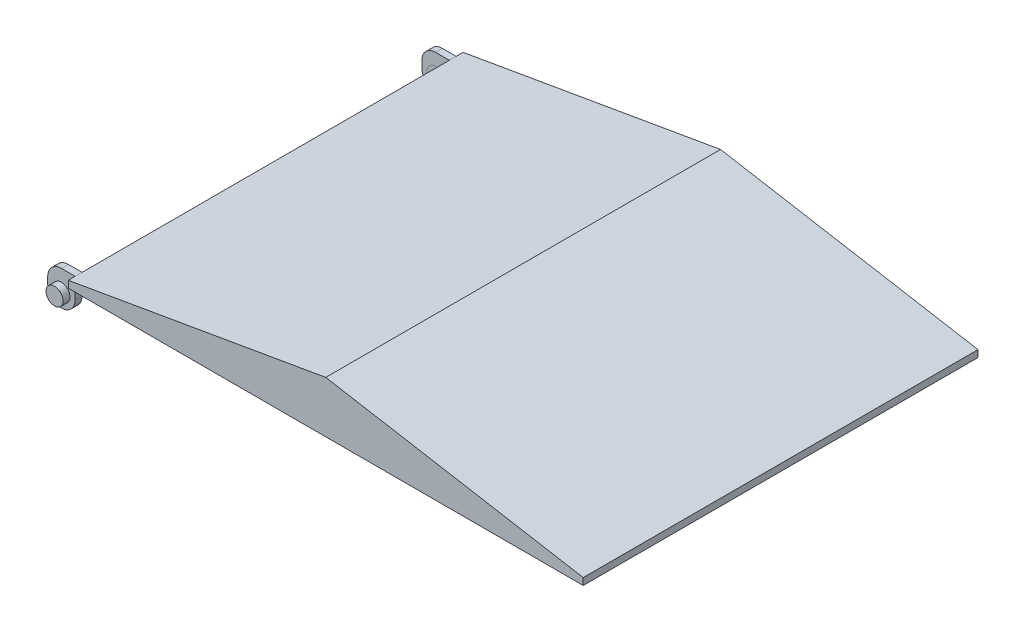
ISO-10303-21;
HEADER;
FILE_DESCRIPTION(('STEP AP214'),'2;1');
FILE_NAME('part.step','',(''),(''),'','','');
FILE_SCHEMA(('AUTOMOTIVE_DESIGN { 1 0 10303 214 1 1 1 1 }'));
ENDSEC;
DATA;
#1=APPLICATION_CONTEXT('core data for automotive mechanical design processes');
#2=APPLICATION_PROTOCOL_DEFINITION('international standard','automotive_design',2000,#1);
#3=PRODUCT_CONTEXT('',#1,'mechanical');
#4=PRODUCT('Part','Part','',(#3));
#5=PRODUCT_RELATED_PRODUCT_CATEGORY('part','',(#4));
#6=PRODUCT_DEFINITION_FORMATION('','',#4);
#7=PRODUCT_DEFINITION_CONTEXT('part definition',#1,'design');
#8=PRODUCT_DEFINITION('design','',#6,#7);
#9=PRODUCT_DEFINITION_SHAPE('','',#8);
#10=(LENGTH_UNIT() NAMED_UNIT(*) SI_UNIT(.MILLI.,.METRE.));
#11=(NAMED_UNIT(*) PLANE_ANGLE_UNIT() SI_UNIT($,.RADIAN.));
#12=(NAMED_UNIT(*) SI_UNIT($,.STERADIAN.) SOLID_ANGLE_UNIT());
#13=UNCERTAINTY_MEASURE_WITH_UNIT(LENGTH_MEASURE(1.E-05),#10,'distance_accuracy_value','');
#14=(GEOMETRIC_REPRESENTATION_CONTEXT(3) GLOBAL_UNCERTAINTY_ASSIGNED_CONTEXT((#13)) GLOBAL_UNIT_ASSIGNED_CONTEXT((#10,
#11,#12)) REPRESENTATION_CONTEXT('',''));
#15=CARTESIAN_POINT('',(0.,0.,0.));
#16=DIRECTION('',(0.,0.,1.));
#17=DIRECTION('',(1.,0.,0.));
#18=AXIS2_PLACEMENT_3D('',#15,#16,#17);
#19=CARTESIAN_POINT('',(-790.,-40.0000000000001,1150.));
#20=DIRECTION('',(0.,0.,-1.));
#21=DIRECTION('',(-1.,0.,0.));
#22=AXIS2_PLACEMENT_3D('',#19,#20,#21);
#23=CYLINDRICAL_SURFACE('',#22,25.);
#24=CARTESIAN_POINT('',(-790.,-40.0000000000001,1150.));
#25=DIRECTION('',(0.,0.,1.));
#26=DIRECTION('',(1.,0.,0.));
#27=AXIS2_PLACEMENT_3D('',#24,#25,#26);
#28=CIRCLE('',#27,25.);
#29=CARTESIAN_POINT('',(-765.,-40.0000000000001,1150.));
#30=VERTEX_POINT('',#29);
#31=EDGE_CURVE('E11',#30,#30,#28,.T.);
#32=ORIENTED_EDGE('',*,*,#31,.F.);
#33=EDGE_LOOP('',(#32));
#34=FACE_BOUND('',#33,.T.);
#35=CARTESIAN_POINT('',(-790.,-40.0000000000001,1110.));
#36=DIRECTION('',(0.,0.,1.));
#37=DIRECTION('',(1.,0.,0.));
#38=AXIS2_PLACEMENT_3D('',#35,#36,#37);
#39=CIRCLE('',#38,25.);
#40=CARTESIAN_POINT('',(-765.,-40.0000000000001,1110.));
#41=VERTEX_POINT('',#40);
#42=EDGE_CURVE('E53',#41,#41,#39,.T.);
#43=ORIENTED_EDGE('',*,*,#42,.T.);
#44=EDGE_LOOP('',(#43));
#45=FACE_BOUND('',#44,.T.);
#46=ADVANCED_FACE('F50',(#34,#45),#23,.T.);
#47=CARTESIAN_POINT('',(0.,0.,1150.));
#48=DIRECTION('',(0.,0.,1.));
#49=DIRECTION('',(1.,0.,0.));
#50=AXIS2_PLACEMENT_3D('',#47,#48,#49);
#51=PLANE('',#50);
#52=ORIENTED_EDGE('',*,*,#31,.T.);
#53=EDGE_LOOP('',(#52));
#54=FACE_BOUND('',#53,.T.);
#55=ADVANCED_FACE('F65',(#54),#51,.T.);
#56=CARTESIAN_POINT('',(0.,0.,1110.));
#57=DIRECTION('',(0.,0.,1.));
#58=DIRECTION('',(1.,0.,0.));
#59=AXIS2_PLACEMENT_3D('',#56,#57,#58);
#60=PLANE('',#59);
#61=ORIENTED_EDGE('',*,*,#42,.F.);
#62=EDGE_LOOP('',(#61));
#63=FACE_BOUND('',#62,.T.);
#64=ADVANCED_FACE('F63',(#63),#60,.F.);
#65=CLOSED_SHELL('',(#46,#55,#64));
#66=MANIFOLD_SOLID_BREP('B2',#65);
#67=CARTESIAN_POINT('',(-790.,-40.0000000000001,40.));
#68=DIRECTION('',(0.,0.,-1.));
#69=DIRECTION('',(-1.,0.,0.));
#70=AXIS2_PLACEMENT_3D('',#67,#68,#69);
#71=CYLINDRICAL_SURFACE('',#70,25.);
#72=CARTESIAN_POINT('',(-790.,-40.0000000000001,40.));
#73=DIRECTION('',(0.,0.,1.));
#74=DIRECTION('',(1.,0.,0.));
#75=AXIS2_PLACEMENT_3D('',#72,#73,#74);
#76=CIRCLE('',#75,25.);
#77=CARTESIAN_POINT('',(-765.,-40.0000000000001,40.));
#78=VERTEX_POINT('',#77);
#79=EDGE_CURVE('E49',#78,#78,#76,.T.);
#80=ORIENTED_EDGE('',*,*,#79,.F.);
#81=EDGE_LOOP('',(#80));
#82=FACE_BOUND('',#81,.T.);
#83=CARTESIAN_POINT('',(-790.,-40.0000000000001,0.));
#84=DIRECTION('',(0.,0.,1.));
#85=DIRECTION('',(1.,0.,0.));
#86=AXIS2_PLACEMENT_3D('',#83,#84,#85);
#87=CIRCLE('',#86,25.);
#88=CARTESIAN_POINT('',(-765.,-40.0000000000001,0.));
#89=VERTEX_POINT('',#88);
#90=EDGE_CURVE('E109',#89,#89,#87,.T.);
#91=ORIENTED_EDGE('',*,*,#90,.T.);
#92=EDGE_LOOP('',(#91));
#93=FACE_BOUND('',#92,.T.);
#94=ADVANCED_FACE('F106',(#82,#93),#71,.T.);
#95=CARTESIAN_POINT('',(0.,0.,40.));
#96=DIRECTION('',(0.,0.,1.));
#97=DIRECTION('',(1.,0.,0.));
#98=AXIS2_PLACEMENT_3D('',#95,#96,#97);
#99=PLANE('',#98);
#100=ORIENTED_EDGE('',*,*,#79,.T.);
#101=EDGE_LOOP('',(#100));
#102=FACE_BOUND('',#101,.T.);
#103=ADVANCED_FACE('F121',(#102),#99,.T.);
#104=CARTESIAN_POINT('',(0.,0.,0.));
#105=DIRECTION('',(0.,0.,1.));
#106=DIRECTION('',(1.,0.,0.));
#107=AXIS2_PLACEMENT_3D('',#104,#105,#106);
#108=PLANE('',#107);
#109=ORIENTED_EDGE('',*,*,#90,.F.);
#110=EDGE_LOOP('',(#109));
#111=FACE_BOUND('',#110,.T.);
#112=ADVANCED_FACE('F119',(#111),#108,.F.);
#113=CLOSED_SHELL('',(#94,#103,#112));
#114=MANIFOLD_SOLID_BREP('B6',#113);
#115=CARTESIAN_POINT('',(-750.,0.,1150.));
#116=DIRECTION('',(1.,0.,0.));
#117=DIRECTION('',(0.,0.,-1.));
#118=AXIS2_PLACEMENT_3D('',#115,#116,#117);
#119=PLANE('',#118);
#120=DIRECTION('',(0.,-1.,0.));
#121=VECTOR('',#120,1.);
#122=CARTESIAN_POINT('',(-750.,0.,1110.));
#123=LINE('',#122,#121);
#124=CARTESIAN_POINT('',(-750.,19.9999999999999,1110.));
#125=VERTEX_POINT('',#124);
#126=CARTESIAN_POINT('',(-750.,0.,1110.));
#127=VERTEX_POINT('',#126);
#128=EDGE_CURVE('E453',#125,#127,#123,.T.);
#129=ORIENTED_EDGE('',*,*,#128,.F.);
#130=DIRECTION('',(0.,0.,-1.));
#131=VECTOR('',#130,1.);
#132=CARTESIAN_POINT('',(-750.,19.9999999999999,1150.));
#133=LINE('',#132,#131);
#134=CARTESIAN_POINT('',(-750.,19.9999999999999,40.));
#135=VERTEX_POINT('',#134);
#136=EDGE_CURVE('E346',#125,#135,#133,.T.);
#137=ORIENTED_EDGE('',*,*,#136,.T.);
#138=DIRECTION('',(0.,-1.,0.));
#139=VECTOR('',#138,1.);
#140=CARTESIAN_POINT('',(-750.,0.,40.));
#141=LINE('',#140,#139);
#142=CARTESIAN_POINT('',(-750.,0.,40.));
#143=VERTEX_POINT('',#142);
#144=EDGE_CURVE('E462',#135,#143,#141,.T.);
#145=ORIENTED_EDGE('',*,*,#144,.T.);
#146=DIRECTION('',(0.,0.,-1.));
#147=VECTOR('',#146,1.);
#148=CARTESIAN_POINT('',(-750.,0.,1150.));
#149=LINE('',#148,#147);
#150=EDGE_CURVE('E367',#127,#143,#149,.T.);
#151=ORIENTED_EDGE('',*,*,#150,.F.);
#152=EDGE_LOOP('',(#129,#137,#145,#151));
#153=FACE_BOUND('',#152,.T.);
#154=ADVANCED_FACE('F154',(#153),#119,.F.);
#155=DIRECTION('',(0.,-1.,0.));
#156=VECTOR('',#155,1.);
#157=CARTESIAN_POINT('',(-750.,0.,20.));
#158=LINE('',#157,#156);
#159=CARTESIAN_POINT('',(-750.,19.9999999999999,20.));
#160=VERTEX_POINT('',#159);
#161=CARTESIAN_POINT('',(-750.,0.,20.));
#162=VERTEX_POINT('',#161);
#163=EDGE_CURVE('E474',#160,#162,#158,.T.);
#164=ORIENTED_EDGE('',*,*,#163,.F.);
#165=CARTESIAN_POINT('',(-750.,19.9999999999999,0.));
#166=VERTEX_POINT('',#165);
#167=EDGE_CURVE('E354',#160,#166,#133,.T.);
#168=ORIENTED_EDGE('',*,*,#167,.T.);
#169=DIRECTION('',(0.,-1.,0.));
#170=VECTOR('',#169,1.);
#171=CARTESIAN_POINT('',(-750.,0.,0.));
#172=LINE('',#171,#170);
#173=CARTESIAN_POINT('',(-750.,0.,0.));
#174=VERTEX_POINT('',#173);
#175=EDGE_CURVE('E525',#166,#174,#172,.T.);
#176=ORIENTED_EDGE('',*,*,#175,.T.);
#177=EDGE_CURVE('E372',#162,#174,#149,.T.);
#178=ORIENTED_EDGE('',*,*,#177,.F.);
#179=EDGE_LOOP('',(#164,#168,#176,#178));
#180=FACE_BOUND('',#179,.T.);
#181=ADVANCED_FACE('F542',(#180),#119,.F.);
#182=CARTESIAN_POINT('',(-25.2416292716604,145.624784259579,1150.));
#183=DIRECTION('',(-0.170786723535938,0.985308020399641,0.));
#184=DIRECTION('',(-0.985308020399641,-0.170786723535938,0.));
#185=AXIS2_PLACEMENT_3D('',#182,#183,#184);
#186=PLANE('',#185);
#187=DIRECTION('',(0.985308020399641,0.170786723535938,0.));
#188=VECTOR('',#187,1.);
#189=CARTESIAN_POINT('',(-25.2416292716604,145.624784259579,0.));
#190=LINE('',#189,#188);
#191=CARTESIAN_POINT('',(0.,150.,0.));
#192=VERTEX_POINT('',#191);
#193=EDGE_CURVE('E514',#166,#192,#190,.T.);
#194=ORIENTED_EDGE('',*,*,#193,.F.);
#195=ORIENTED_EDGE('',*,*,#167,.F.);
#196=DIRECTION('',(0.,0.,-1.));
#197=VECTOR('',#196,1.);
#198=CARTESIAN_POINT('',(-750.,19.9999999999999,40.));
#199=LINE('',#198,#197);
#200=EDGE_CURVE('E470',#135,#160,#199,.T.);
#201=ORIENTED_EDGE('',*,*,#200,.F.);
#202=ORIENTED_EDGE('',*,*,#136,.F.);
#203=DIRECTION('',(0.,0.,-1.));
#204=VECTOR('',#203,1.);
#205=CARTESIAN_POINT('',(-750.,19.9999999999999,1130.));
#206=LINE('',#205,#204);
#207=CARTESIAN_POINT('',(-750.,19.9999999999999,1130.));
#208=VERTEX_POINT('',#207);
#209=EDGE_CURVE('E321',#208,#125,#206,.T.);
#210=ORIENTED_EDGE('',*,*,#209,.F.);
#211=CARTESIAN_POINT('',(-750.,19.9999999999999,1150.));
#212=VERTEX_POINT('',#211);
#213=EDGE_CURVE('E342',#212,#208,#133,.T.);
#214=ORIENTED_EDGE('',*,*,#213,.F.);
#215=DIRECTION('',(0.985308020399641,0.170786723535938,0.));
#216=VECTOR('',#215,1.);
#217=CARTESIAN_POINT('',(-25.2416292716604,145.624784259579,1150.));
#218=LINE('',#217,#216);
#219=CARTESIAN_POINT('',(0.,150.,1150.));
#220=VERTEX_POINT('',#219);
#221=EDGE_CURVE('E522',#212,#220,#218,.T.);
#222=ORIENTED_EDGE('',*,*,#221,.T.);
#223=DIRECTION('',(0.,0.,-1.));
#224=VECTOR('',#223,1.);
#225=CARTESIAN_POINT('',(0.,150.,1150.));
#226=LINE('',#225,#224);
#227=EDGE_CURVE('E383',#220,#192,#226,.T.);
#228=ORIENTED_EDGE('',*,*,#227,.T.);
#229=EDGE_LOOP('',(#194,#195,#201,#202,#210,#214,#222,#228));
#230=FACE_BOUND('',#229,.T.);
#231=ADVANCED_FACE('F340',(#230),#186,.T.);
#232=ORIENTED_EDGE('',*,*,#213,.T.);
#233=DIRECTION('',(0.,-1.,0.));
#234=VECTOR('',#233,1.);
#235=CARTESIAN_POINT('',(-750.,0.,1130.));
#236=LINE('',#235,#234);
#237=CARTESIAN_POINT('',(-750.,0.,1130.));
#238=VERTEX_POINT('',#237);
#239=EDGE_CURVE('E325',#208,#238,#236,.T.);
#240=ORIENTED_EDGE('',*,*,#239,.T.);
#241=CARTESIAN_POINT('',(-750.,0.,1150.));
#242=VERTEX_POINT('',#241);
#243=EDGE_CURVE('E360',#242,#238,#149,.T.);
#244=ORIENTED_EDGE('',*,*,#243,.F.);
#245=DIRECTION('',(0.,-1.,0.));
#246=VECTOR('',#245,1.);
#247=CARTESIAN_POINT('',(-750.,0.,1150.));
#248=LINE('',#247,#246);
#249=EDGE_CURVE('E350',#212,#242,#248,.T.);
#250=ORIENTED_EDGE('',*,*,#249,.F.);
#251=EDGE_LOOP('',(#232,#240,#244,#250));
#252=FACE_BOUND('',#251,.T.);
#253=ADVANCED_FACE('F349',(#252),#119,.F.);
#254=CARTESIAN_POINT('',(0.,0.,1150.));
#255=DIRECTION('',(0.,-1.,0.));
#256=DIRECTION('',(1.,0.,0.));
#257=AXIS2_PLACEMENT_3D('',#254,#255,#256);
#258=PLANE('',#257);
#259=DIRECTION('',(-1.,0.,0.));
#260=VECTOR('',#259,1.);
#261=CARTESIAN_POINT('',(0.,0.,0.));
#262=LINE('',#261,#260);
#263=CARTESIAN_POINT('',(750.,0.,0.));
#264=VERTEX_POINT('',#263);
#265=EDGE_CURVE('E540',#264,#174,#262,.T.);
#266=ORIENTED_EDGE('',*,*,#265,.F.);
#267=DIRECTION('',(0.,0.,-1.));
#268=VECTOR('',#267,1.);
#269=CARTESIAN_POINT('',(750.,0.,1150.));
#270=LINE('',#269,#268);
#271=CARTESIAN_POINT('',(750.,0.,1150.));
#272=VERTEX_POINT('',#271);
#273=EDGE_CURVE('E376',#272,#264,#270,.T.);
#274=ORIENTED_EDGE('',*,*,#273,.F.);
#275=DIRECTION('',(-1.,0.,0.));
#276=VECTOR('',#275,1.);
#277=CARTESIAN_POINT('',(0.,0.,1150.));
#278=LINE('',#277,#276);
#279=EDGE_CURVE('E529',#272,#242,#278,.T.);
#280=ORIENTED_EDGE('',*,*,#279,.T.);
#281=ORIENTED_EDGE('',*,*,#243,.T.);
#282=EDGE_CURVE('E366',#238,#127,#149,.T.);
#283=ORIENTED_EDGE('',*,*,#282,.T.);
#284=ORIENTED_EDGE('',*,*,#150,.T.);
#285=EDGE_CURVE('E368',#143,#162,#149,.T.);
#286=ORIENTED_EDGE('',*,*,#285,.T.);
#287=ORIENTED_EDGE('',*,*,#177,.T.);
#288=EDGE_LOOP('',(#266,#274,#280,#281,#283,#284,#286,#287));
#289=FACE_BOUND('',#288,.T.);
#290=ADVANCED_FACE('F546',(#289),#258,.T.);
#291=CARTESIAN_POINT('',(750.,0.,1150.));
#292=DIRECTION('',(1.,0.,0.));
#293=DIRECTION('',(0.,0.,-1.));
#294=AXIS2_PLACEMENT_3D('',#291,#292,#293);
#295=PLANE('',#294);
#296=DIRECTION('',(0.,-1.,0.));
#297=VECTOR('',#296,1.);
#298=CARTESIAN_POINT('',(750.,0.,0.));
#299=LINE('',#298,#297);
#300=CARTESIAN_POINT('',(750.,20.0000000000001,0.));
#301=VERTEX_POINT('',#300);
#302=EDGE_CURVE('E537',#301,#264,#299,.T.);
#303=ORIENTED_EDGE('',*,*,#302,.F.);
#304=DIRECTION('',(0.,0.,-1.));
#305=VECTOR('',#304,1.);
#306=CARTESIAN_POINT('',(750.,20.0000000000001,1150.));
#307=LINE('',#306,#305);
#308=CARTESIAN_POINT('',(750.,20.0000000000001,1150.));
#309=VERTEX_POINT('',#308);
#310=EDGE_CURVE('E379',#309,#301,#307,.T.);
#311=ORIENTED_EDGE('',*,*,#310,.F.);
#312=DIRECTION('',(0.,-1.,0.));
#313=VECTOR('',#312,1.);
#314=CARTESIAN_POINT('',(750.,0.,1150.));
#315=LINE('',#314,#313);
#316=EDGE_CURVE('E527',#309,#272,#315,.T.);
#317=ORIENTED_EDGE('',*,*,#316,.T.);
#318=ORIENTED_EDGE('',*,*,#273,.T.);
#319=EDGE_LOOP('',(#303,#311,#317,#318));
#320=FACE_BOUND('',#319,.T.);
#321=ADVANCED_FACE('F551',(#320),#295,.T.);
#322=CARTESIAN_POINT('',(25.2416292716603,145.624784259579,1150.));
#323=DIRECTION('',(-0.170786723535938,-0.985308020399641,0.));
#324=DIRECTION('',(0.985308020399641,-0.170786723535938,0.));
#325=AXIS2_PLACEMENT_3D('',#322,#323,#324);
#326=PLANE('',#325);
#327=DIRECTION('',(-0.985308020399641,0.170786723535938,0.));
#328=VECTOR('',#327,1.);
#329=CARTESIAN_POINT('',(25.2416292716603,145.624784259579,0.));
#330=LINE('',#329,#328);
#331=EDGE_CURVE('E534',#301,#192,#330,.T.);
#332=ORIENTED_EDGE('',*,*,#331,.T.);
#333=ORIENTED_EDGE('',*,*,#227,.F.);
#334=DIRECTION('',(-0.985308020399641,0.170786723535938,0.));
#335=VECTOR('',#334,1.);
#336=CARTESIAN_POINT('',(25.2416292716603,145.624784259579,1150.));
#337=LINE('',#336,#335);
#338=EDGE_CURVE('E524',#309,#220,#337,.T.);
#339=ORIENTED_EDGE('',*,*,#338,.F.);
#340=ORIENTED_EDGE('',*,*,#310,.T.);
#341=EDGE_LOOP('',(#332,#333,#339,#340));
#342=FACE_BOUND('',#341,.T.);
#343=ADVANCED_FACE('F555',(#342),#326,.F.);
#344=CARTESIAN_POINT('',(0.,0.,1150.));
#345=DIRECTION('',(0.,0.,-1.));
#346=DIRECTION('',(-1.,0.,0.));
#347=AXIS2_PLACEMENT_3D('',#344,#345,#346);
#348=PLANE('',#347);
#349=ORIENTED_EDGE('',*,*,#221,.F.);
#350=ORIENTED_EDGE('',*,*,#249,.T.);
#351=ORIENTED_EDGE('',*,*,#279,.F.);
#352=ORIENTED_EDGE('',*,*,#316,.F.);
#353=ORIENTED_EDGE('',*,*,#338,.T.);
#354=EDGE_LOOP('',(#349,#350,#351,#352,#353));
#355=FACE_BOUND('',#354,.T.);
#356=ADVANCED_FACE('F550',(#355),#348,.F.);
#357=CARTESIAN_POINT('',(0.,0.,0.));
#358=DIRECTION('',(0.,0.,-1.));
#359=DIRECTION('',(-1.,0.,0.));
#360=AXIS2_PLACEMENT_3D('',#357,#358,#359);
#361=PLANE('',#360);
#362=ORIENTED_EDGE('',*,*,#193,.T.);
#363=ORIENTED_EDGE('',*,*,#331,.F.);
#364=ORIENTED_EDGE('',*,*,#302,.T.);
#365=ORIENTED_EDGE('',*,*,#265,.T.);
#366=ORIENTED_EDGE('',*,*,#175,.F.);
#367=EDGE_LOOP('',(#362,#363,#364,#365,#366));
#368=FACE_BOUND('',#367,.T.);
#369=ADVANCED_FACE('F544',(#368),#361,.T.);
#370=CARTESIAN_POINT('',(-750.,0.,40.));
#371=DIRECTION('',(1.,0.,0.));
#372=DIRECTION('',(0.,0.,-1.));
#373=AXIS2_PLACEMENT_3D('',#370,#371,#372);
#374=PLANE('',#373);
#375=CARTESIAN_POINT('',(-750.,-40.0000000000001,40.));
#376=VERTEX_POINT('',#375);
#377=EDGE_CURVE('E460',#143,#376,#141,.T.);
#378=ORIENTED_EDGE('',*,*,#377,.T.);
#379=DIRECTION('',(0.,0.,-1.));
#380=VECTOR('',#379,1.);
#381=CARTESIAN_POINT('',(-750.,-40.0000000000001,40.));
#382=LINE('',#381,#380);
#383=CARTESIAN_POINT('',(-750.,-40.0000000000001,20.));
#384=VERTEX_POINT('',#383);
#385=EDGE_CURVE('E352',#376,#384,#382,.T.);
#386=ORIENTED_EDGE('',*,*,#385,.T.);
#387=EDGE_CURVE('E473',#162,#384,#158,.T.);
#388=ORIENTED_EDGE('',*,*,#387,.F.);
#389=ORIENTED_EDGE('',*,*,#285,.F.);
#390=EDGE_LOOP('',(#378,#386,#388,#389));
#391=FACE_BOUND('',#390,.T.);
#392=ADVANCED_FACE('F585',(#391),#374,.T.);
#393=CARTESIAN_POINT('',(0.,19.9999999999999,40.));
#394=DIRECTION('',(0.,1.,0.));
#395=DIRECTION('',(0.,0.,1.));
#396=AXIS2_PLACEMENT_3D('',#393,#394,#395);
#397=PLANE('',#396);
#398=DIRECTION('',(1.,0.,0.));
#399=VECTOR('',#398,1.);
#400=CARTESIAN_POINT('',(0.,19.9999999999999,20.));
#401=LINE('',#400,#399);
#402=CARTESIAN_POINT('',(-790.,19.9999999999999,20.));
#403=VERTEX_POINT('',#402);
#404=EDGE_CURVE('E477',#403,#160,#401,.T.);
#405=ORIENTED_EDGE('',*,*,#404,.F.);
#406=DIRECTION('',(0.,0.,-1.));
#407=VECTOR('',#406,1.);
#408=CARTESIAN_POINT('',(-790.,19.9999999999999,40.));
#409=LINE('',#408,#407);
#410=CARTESIAN_POINT('',(-790.,19.9999999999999,40.));
#411=VERTEX_POINT('',#410);
#412=EDGE_CURVE('E403',#403,#411,#409,.F.);
#413=ORIENTED_EDGE('',*,*,#412,.T.);
#414=DIRECTION('',(1.,0.,0.));
#415=VECTOR('',#414,1.);
#416=CARTESIAN_POINT('',(0.,19.9999999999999,40.));
#417=LINE('',#416,#415);
#418=EDGE_CURVE('E465',#411,#135,#417,.T.);
#419=ORIENTED_EDGE('',*,*,#418,.T.);
#420=ORIENTED_EDGE('',*,*,#200,.T.);
#421=EDGE_LOOP('',(#405,#413,#419,#420));
#422=FACE_BOUND('',#421,.T.);
#423=ADVANCED_FACE('F558',(#422),#397,.T.);
#424=CARTESIAN_POINT('',(-830.,0.,40.));
#425=DIRECTION('',(-1.,0.,0.));
#426=DIRECTION('',(0.,0.,1.));
#427=AXIS2_PLACEMENT_3D('',#424,#425,#426);
#428=PLANE('',#427);
#429=DIRECTION('',(0.,1.,0.));
#430=VECTOR('',#429,1.);
#431=CARTESIAN_POINT('',(-830.,0.,20.));
#432=LINE('',#431,#430);
#433=CARTESIAN_POINT('',(-830.,-40.0000000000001,20.));
#434=VERTEX_POINT('',#433);
#435=CARTESIAN_POINT('',(-830.,-20.0000000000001,20.));
#436=VERTEX_POINT('',#435);
#437=EDGE_CURVE('E461',#434,#436,#432,.T.);
#438=ORIENTED_EDGE('',*,*,#437,.F.);
#439=DIRECTION('',(0.,0.,-1.));
#440=VECTOR('',#439,1.);
#441=CARTESIAN_POINT('',(-830.,-40.0000000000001,40.));
#442=LINE('',#441,#440);
#443=CARTESIAN_POINT('',(-830.,-40.0000000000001,40.));
#444=VERTEX_POINT('',#443);
#445=EDGE_CURVE('E401',#434,#444,#442,.F.);
#446=ORIENTED_EDGE('',*,*,#445,.T.);
#447=DIRECTION('',(0.,1.,0.));
#448=VECTOR('',#447,1.);
#449=CARTESIAN_POINT('',(-830.,0.,40.));
#450=LINE('',#449,#448);
#451=CARTESIAN_POINT('',(-830.,-20.0000000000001,40.));
#452=VERTEX_POINT('',#451);
#453=EDGE_CURVE('E467',#444,#452,#450,.T.);
#454=ORIENTED_EDGE('',*,*,#453,.T.);
#455=DIRECTION('',(0.,0.,-1.));
#456=VECTOR('',#455,1.);
#457=CARTESIAN_POINT('',(-830.,-20.0000000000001,40.));
#458=LINE('',#457,#456);
#459=EDGE_CURVE('E398',#452,#436,#458,.T.);
#460=ORIENTED_EDGE('',*,*,#459,.T.);
#461=EDGE_LOOP('',(#438,#446,#454,#460));
#462=FACE_BOUND('',#461,.T.);
#463=ADVANCED_FACE('F570',(#462),#428,.T.);
#464=CARTESIAN_POINT('',(-790.,-40.0000000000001,40.));
#465=DIRECTION('',(0.,0.,-1.));
#466=DIRECTION('',(-1.,0.,0.));
#467=AXIS2_PLACEMENT_3D('',#464,#465,#466);
#468=CYLINDRICAL_SURFACE('',#467,25.);
#469=CARTESIAN_POINT('',(-790.,-40.0000000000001,40.));
#470=DIRECTION('',(0.,0.,1.));
#471=DIRECTION('',(1.,0.,0.));
#472=AXIS2_PLACEMENT_3D('',#469,#470,#471);
#473=CIRCLE('',#472,25.);
#474=CARTESIAN_POINT('',(-765.,-40.0000000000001,40.));
#475=VERTEX_POINT('',#474);
#476=EDGE_CURVE('E457',#475,#475,#473,.T.);
#477=ORIENTED_EDGE('',*,*,#476,.T.);
#478=EDGE_LOOP('',(#477));
#479=FACE_BOUND('',#478,.T.);
#480=CARTESIAN_POINT('',(-790.,-40.0000000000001,20.));
#481=DIRECTION('',(0.,0.,1.));
#482=DIRECTION('',(1.,0.,0.));
#483=AXIS2_PLACEMENT_3D('',#480,#481,#482);
#484=CIRCLE('',#483,25.);
#485=CARTESIAN_POINT('',(-765.,-40.0000000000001,20.));
#486=VERTEX_POINT('',#485);
#487=EDGE_CURVE('E347',#486,#486,#484,.T.);
#488=ORIENTED_EDGE('',*,*,#487,.F.);
#489=EDGE_LOOP('',(#488));
#490=FACE_BOUND('',#489,.T.);
#491=ADVANCED_FACE('F737',(#479,#490),#468,.F.);
#492=CARTESIAN_POINT('',(0.,0.,40.));
#493=DIRECTION('',(0.,0.,1.));
#494=DIRECTION('',(1.,0.,0.));
#495=AXIS2_PLACEMENT_3D('',#492,#493,#494);
#496=PLANE('',#495);
#497=ORIENTED_EDGE('',*,*,#476,.F.);
#498=EDGE_LOOP('',(#497));
#499=FACE_BOUND('',#498,.T.);
#500=CARTESIAN_POINT('',(-790.,-40.0000000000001,40.));
#501=DIRECTION('',(0.,0.,1.));
#502=DIRECTION('',(1.,0.,0.));
#503=AXIS2_PLACEMENT_3D('',#500,#501,#502);
#504=CIRCLE('',#503,40.);
#505=CARTESIAN_POINT('',(-790.,-80.0000000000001,40.));
#506=VERTEX_POINT('',#505);
#507=EDGE_CURVE('E394',#444,#506,#504,.T.);
#508=ORIENTED_EDGE('',*,*,#507,.T.);
#509=CARTESIAN_POINT('',(-790.,-40.0000000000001,40.));
#510=DIRECTION('',(0.,0.,1.));
#511=DIRECTION('',(1.,0.,0.));
#512=AXIS2_PLACEMENT_3D('',#509,#510,#511);
#513=CIRCLE('',#512,40.);
#514=EDGE_CURVE('E396',#506,#376,#513,.T.);
#515=ORIENTED_EDGE('',*,*,#514,.T.);
#516=ORIENTED_EDGE('',*,*,#377,.F.);
#517=ORIENTED_EDGE('',*,*,#144,.F.);
#518=ORIENTED_EDGE('',*,*,#418,.F.);
#519=CARTESIAN_POINT('',(-790.,-20.0000000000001,40.));
#520=DIRECTION('',(0.,0.,1.));
#521=DIRECTION('',(1.,0.,0.));
#522=AXIS2_PLACEMENT_3D('',#519,#520,#521);
#523=CIRCLE('',#522,40.);
#524=EDGE_CURVE('E392',#411,#452,#523,.T.);
#525=ORIENTED_EDGE('',*,*,#524,.T.);
#526=ORIENTED_EDGE('',*,*,#453,.F.);
#527=EDGE_LOOP('',(#508,#515,#516,#517,#518,#525,#526));
#528=FACE_BOUND('',#527,.T.);
#529=ADVANCED_FACE('F575',(#499,#528),#496,.T.);
#530=CARTESIAN_POINT('',(0.,0.,20.));
#531=DIRECTION('',(0.,0.,1.));
#532=DIRECTION('',(1.,0.,0.));
#533=AXIS2_PLACEMENT_3D('',#530,#531,#532);
#534=PLANE('',#533);
#535=ORIENTED_EDGE('',*,*,#487,.T.);
#536=EDGE_LOOP('',(#535));
#537=FACE_BOUND('',#536,.T.);
#538=ORIENTED_EDGE('',*,*,#387,.T.);
#539=CARTESIAN_POINT('',(-790.,-40.0000000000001,20.));
#540=DIRECTION('',(0.,0.,1.));
#541=DIRECTION('',(1.,0.,0.));
#542=AXIS2_PLACEMENT_3D('',#539,#540,#541);
#543=CIRCLE('',#542,40.);
#544=CARTESIAN_POINT('',(-790.,-80.0000000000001,20.));
#545=VERTEX_POINT('',#544);
#546=EDGE_CURVE('E390',#384,#545,#543,.F.);
#547=ORIENTED_EDGE('',*,*,#546,.T.);
#548=CARTESIAN_POINT('',(-790.,-40.0000000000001,20.));
#549=DIRECTION('',(0.,0.,1.));
#550=DIRECTION('',(1.,0.,0.));
#551=AXIS2_PLACEMENT_3D('',#548,#549,#550);
#552=CIRCLE('',#551,40.);
#553=EDGE_CURVE('E388',#545,#434,#552,.F.);
#554=ORIENTED_EDGE('',*,*,#553,.T.);
#555=ORIENTED_EDGE('',*,*,#437,.T.);
#556=CARTESIAN_POINT('',(-790.,-20.0000000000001,20.));
#557=DIRECTION('',(0.,0.,1.));
#558=DIRECTION('',(1.,0.,0.));
#559=AXIS2_PLACEMENT_3D('',#556,#557,#558);
#560=CIRCLE('',#559,40.);
#561=EDGE_CURVE('E356',#436,#403,#560,.F.);
#562=ORIENTED_EDGE('',*,*,#561,.T.);
#563=ORIENTED_EDGE('',*,*,#404,.T.);
#564=ORIENTED_EDGE('',*,*,#163,.T.);
#565=EDGE_LOOP('',(#538,#547,#554,#555,#562,#563,#564));
#566=FACE_BOUND('',#565,.T.);
#567=ADVANCED_FACE('F563',(#537,#566),#534,.F.);
#568=CARTESIAN_POINT('',(-750.,0.,1130.));
#569=DIRECTION('',(1.,0.,0.));
#570=DIRECTION('',(0.,0.,-1.));
#571=AXIS2_PLACEMENT_3D('',#568,#569,#570);
#572=PLANE('',#571);
#573=CARTESIAN_POINT('',(-750.,-40.0000000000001,1130.));
#574=VERTEX_POINT('',#573);
#575=EDGE_CURVE('E331',#238,#574,#236,.T.);
#576=ORIENTED_EDGE('',*,*,#575,.T.);
#577=DIRECTION('',(0.,0.,-1.));
#578=VECTOR('',#577,1.);
#579=CARTESIAN_POINT('',(-750.,-40.0000000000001,1130.));
#580=LINE('',#579,#578);
#581=CARTESIAN_POINT('',(-750.,-40.0000000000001,1110.));
#582=VERTEX_POINT('',#581);
#583=EDGE_CURVE('E405',#574,#582,#580,.T.);
#584=ORIENTED_EDGE('',*,*,#583,.T.);
#585=EDGE_CURVE('E428',#127,#582,#123,.T.);
#586=ORIENTED_EDGE('',*,*,#585,.F.);
#587=ORIENTED_EDGE('',*,*,#282,.F.);
#588=EDGE_LOOP('',(#576,#584,#586,#587));
#589=FACE_BOUND('',#588,.T.);
#590=ADVANCED_FACE('F703',(#589),#572,.T.);
#591=CARTESIAN_POINT('',(0.,19.9999999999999,1130.));
#592=DIRECTION('',(0.,1.,0.));
#593=DIRECTION('',(0.,0.,1.));
#594=AXIS2_PLACEMENT_3D('',#591,#592,#593);
#595=PLANE('',#594);
#596=DIRECTION('',(1.,0.,0.));
#597=VECTOR('',#596,1.);
#598=CARTESIAN_POINT('',(0.,19.9999999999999,1110.));
#599=LINE('',#598,#597);
#600=CARTESIAN_POINT('',(-790.,19.9999999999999,1110.));
#601=VERTEX_POINT('',#600);
#602=EDGE_CURVE('E449',#601,#125,#599,.T.);
#603=ORIENTED_EDGE('',*,*,#602,.F.);
#604=DIRECTION('',(0.,0.,-1.));
#605=VECTOR('',#604,1.);
#606=CARTESIAN_POINT('',(-790.,19.9999999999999,1130.));
#607=LINE('',#606,#605);
#608=CARTESIAN_POINT('',(-790.,19.9999999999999,1130.));
#609=VERTEX_POINT('',#608);
#610=EDGE_CURVE('E104',#601,#609,#607,.F.);
#611=ORIENTED_EDGE('',*,*,#610,.T.);
#612=DIRECTION('',(1.,0.,0.));
#613=VECTOR('',#612,1.);
#614=CARTESIAN_POINT('',(0.,19.9999999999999,1130.));
#615=LINE('',#614,#613);
#616=EDGE_CURVE('E316',#609,#208,#615,.T.);
#617=ORIENTED_EDGE('',*,*,#616,.T.);
#618=ORIENTED_EDGE('',*,*,#209,.T.);
#619=EDGE_LOOP('',(#603,#611,#617,#618));
#620=FACE_BOUND('',#619,.T.);
#621=ADVANCED_FACE('F319',(#620),#595,.T.);
#622=CARTESIAN_POINT('',(-830.,0.,1130.));
#623=DIRECTION('',(-1.,0.,0.));
#624=DIRECTION('',(0.,0.,1.));
#625=AXIS2_PLACEMENT_3D('',#622,#623,#624);
#626=PLANE('',#625);
#627=DIRECTION('',(0.,1.,0.));
#628=VECTOR('',#627,1.);
#629=CARTESIAN_POINT('',(-830.,0.,1110.));
#630=LINE('',#629,#628);
#631=CARTESIAN_POINT('',(-830.,-40.0000000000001,1110.));
#632=VERTEX_POINT('',#631);
#633=CARTESIAN_POINT('',(-830.,-20.0000000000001,1110.));
#634=VERTEX_POINT('',#633);
#635=EDGE_CURVE('E444',#632,#634,#630,.T.);
#636=ORIENTED_EDGE('',*,*,#635,.F.);
#637=DIRECTION('',(0.,0.,-1.));
#638=VECTOR('',#637,1.);
#639=CARTESIAN_POINT('',(-830.,-40.0000000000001,1130.));
#640=LINE('',#639,#638);
#641=CARTESIAN_POINT('',(-830.,-40.0000000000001,1130.));
#642=VERTEX_POINT('',#641);
#643=EDGE_CURVE('E163',#632,#642,#640,.F.);
#644=ORIENTED_EDGE('',*,*,#643,.T.);
#645=DIRECTION('',(0.,1.,0.));
#646=VECTOR('',#645,1.);
#647=CARTESIAN_POINT('',(-830.,0.,1130.));
#648=LINE('',#647,#646);
#649=CARTESIAN_POINT('',(-830.,-20.0000000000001,1130.));
#650=VERTEX_POINT('',#649);
#651=EDGE_CURVE('E324',#642,#650,#648,.T.);
#652=ORIENTED_EDGE('',*,*,#651,.T.);
#653=DIRECTION('',(0.,0.,-1.));
#654=VECTOR('',#653,1.);
#655=CARTESIAN_POINT('',(-830.,-20.0000000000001,1130.));
#656=LINE('',#655,#654);
#657=EDGE_CURVE('E418',#650,#634,#656,.T.);
#658=ORIENTED_EDGE('',*,*,#657,.T.);
#659=EDGE_LOOP('',(#636,#644,#652,#658));
#660=FACE_BOUND('',#659,.T.);
#661=ADVANCED_FACE('F446',(#660),#626,.T.);
#662=CARTESIAN_POINT('',(-790.,-40.0000000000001,1130.));
#663=DIRECTION('',(0.,0.,-1.));
#664=DIRECTION('',(-1.,0.,0.));
#665=AXIS2_PLACEMENT_3D('',#662,#663,#664);
#666=CYLINDRICAL_SURFACE('',#665,25.);
#667=CARTESIAN_POINT('',(-790.,-40.0000000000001,1130.));
#668=DIRECTION('',(0.,0.,1.));
#669=DIRECTION('',(1.,0.,0.));
#670=AXIS2_PLACEMENT_3D('',#667,#668,#669);
#671=CIRCLE('',#670,25.);
#672=CARTESIAN_POINT('',(-765.,-40.0000000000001,1130.));
#673=VERTEX_POINT('',#672);
#674=EDGE_CURVE('E448',#673,#673,#671,.T.);
#675=ORIENTED_EDGE('',*,*,#674,.T.);
#676=EDGE_LOOP('',(#675));
#677=FACE_BOUND('',#676,.T.);
#678=CARTESIAN_POINT('',(-790.,-40.0000000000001,1110.));
#679=DIRECTION('',(0.,0.,1.));
#680=DIRECTION('',(1.,0.,0.));
#681=AXIS2_PLACEMENT_3D('',#678,#679,#680);
#682=CIRCLE('',#681,25.);
#683=CARTESIAN_POINT('',(-765.,-40.0000000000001,1110.));
#684=VERTEX_POINT('',#683);
#685=EDGE_CURVE('E423',#684,#684,#682,.T.);
#686=ORIENTED_EDGE('',*,*,#685,.F.);
#687=EDGE_LOOP('',(#686));
#688=FACE_BOUND('',#687,.T.);
#689=ADVANCED_FACE('F676',(#677,#688),#666,.F.);
#690=CARTESIAN_POINT('',(0.,0.,1130.));
#691=DIRECTION('',(0.,0.,1.));
#692=DIRECTION('',(1.,0.,0.));
#693=AXIS2_PLACEMENT_3D('',#690,#691,#692);
#694=PLANE('',#693);
#695=ORIENTED_EDGE('',*,*,#674,.F.);
#696=EDGE_LOOP('',(#695));
#697=FACE_BOUND('',#696,.T.);
#698=CARTESIAN_POINT('',(-790.,-40.0000000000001,1130.));
#699=DIRECTION('',(0.,0.,1.));
#700=DIRECTION('',(1.,0.,0.));
#701=AXIS2_PLACEMENT_3D('',#698,#699,#700);
#702=CIRCLE('',#701,40.);
#703=CARTESIAN_POINT('',(-790.,-80.0000000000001,1130.));
#704=VERTEX_POINT('',#703);
#705=EDGE_CURVE('E171',#642,#704,#702,.T.);
#706=ORIENTED_EDGE('',*,*,#705,.T.);
#707=CARTESIAN_POINT('',(-790.,-40.0000000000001,1130.));
#708=DIRECTION('',(0.,0.,1.));
#709=DIRECTION('',(1.,0.,0.));
#710=AXIS2_PLACEMENT_3D('',#707,#708,#709);
#711=CIRCLE('',#710,40.);
#712=EDGE_CURVE('E416',#704,#574,#711,.T.);
#713=ORIENTED_EDGE('',*,*,#712,.T.);
#714=ORIENTED_EDGE('',*,*,#575,.F.);
#715=ORIENTED_EDGE('',*,*,#239,.F.);
#716=ORIENTED_EDGE('',*,*,#616,.F.);
#717=CARTESIAN_POINT('',(-790.,-20.0000000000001,1130.));
#718=DIRECTION('',(0.,0.,1.));
#719=DIRECTION('',(1.,0.,0.));
#720=AXIS2_PLACEMENT_3D('',#717,#718,#719);
#721=CIRCLE('',#720,40.);
#722=EDGE_CURVE('E177',#609,#650,#721,.T.);
#723=ORIENTED_EDGE('',*,*,#722,.T.);
#724=ORIENTED_EDGE('',*,*,#651,.F.);
#725=EDGE_LOOP('',(#706,#713,#714,#715,#716,#723,#724));
#726=FACE_BOUND('',#725,.T.);
#727=ADVANCED_FACE('F329',(#697,#726),#694,.T.);
#728=CARTESIAN_POINT('',(0.,0.,1110.));
#729=DIRECTION('',(0.,0.,1.));
#730=DIRECTION('',(1.,0.,0.));
#731=AXIS2_PLACEMENT_3D('',#728,#729,#730);
#732=PLANE('',#731);
#733=ORIENTED_EDGE('',*,*,#685,.T.);
#734=EDGE_LOOP('',(#733));
#735=FACE_BOUND('',#734,.T.);
#736=ORIENTED_EDGE('',*,*,#585,.T.);
#737=CARTESIAN_POINT('',(-790.,-40.0000000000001,1110.));
#738=DIRECTION('',(0.,0.,1.));
#739=DIRECTION('',(1.,0.,0.));
#740=AXIS2_PLACEMENT_3D('',#737,#738,#739);
#741=CIRCLE('',#740,40.);
#742=CARTESIAN_POINT('',(-790.,-80.0000000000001,1110.));
#743=VERTEX_POINT('',#742);
#744=EDGE_CURVE('E412',#582,#743,#741,.F.);
#745=ORIENTED_EDGE('',*,*,#744,.T.);
#746=CARTESIAN_POINT('',(-790.,-40.0000000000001,1110.));
#747=DIRECTION('',(0.,0.,1.));
#748=DIRECTION('',(1.,0.,0.));
#749=AXIS2_PLACEMENT_3D('',#746,#747,#748);
#750=CIRCLE('',#749,40.);
#751=EDGE_CURVE('E410',#743,#632,#750,.F.);
#752=ORIENTED_EDGE('',*,*,#751,.T.);
#753=ORIENTED_EDGE('',*,*,#635,.T.);
#754=CARTESIAN_POINT('',(-790.,-20.0000000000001,1110.));
#755=DIRECTION('',(0.,0.,1.));
#756=DIRECTION('',(1.,0.,0.));
#757=AXIS2_PLACEMENT_3D('',#754,#755,#756);
#758=CIRCLE('',#757,40.);
#759=EDGE_CURVE('E408',#634,#601,#758,.F.);
#760=ORIENTED_EDGE('',*,*,#759,.T.);
#761=ORIENTED_EDGE('',*,*,#602,.T.);
#762=ORIENTED_EDGE('',*,*,#128,.T.);
#763=EDGE_LOOP('',(#736,#745,#752,#753,#760,#761,#762));
#764=FACE_BOUND('',#763,.T.);
#765=ADVANCED_FACE('F443',(#735,#764),#732,.F.);
#766=CARTESIAN_POINT('',(-790.,-40.0000000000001,40.));
#767=DIRECTION('',(0.,0.,-1.));
#768=DIRECTION('',(-1.,0.,0.));
#769=AXIS2_PLACEMENT_3D('',#766,#767,#768);
#770=CYLINDRICAL_SURFACE('',#769,40.);
#771=DIRECTION('',(0.,0.,-1.));
#772=VECTOR('',#771,1.);
#773=CARTESIAN_POINT('',(-790.,-80.0000000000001,40.));
#774=LINE('',#773,#772);
#775=EDGE_CURVE('E421',#506,#545,#774,.T.);
#776=ORIENTED_EDGE('',*,*,#775,.F.);
#777=ORIENTED_EDGE('',*,*,#507,.F.);
#778=ORIENTED_EDGE('',*,*,#445,.F.);
#779=ORIENTED_EDGE('',*,*,#553,.F.);
#780=EDGE_LOOP('',(#776,#777,#778,#779));
#781=FACE_BOUND('',#780,.T.);
#782=ADVANCED_FACE('F577',(#781),#770,.T.);
#783=CARTESIAN_POINT('',(-790.,-40.0000000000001,40.));
#784=DIRECTION('',(0.,0.,-1.));
#785=DIRECTION('',(-1.,0.,0.));
#786=AXIS2_PLACEMENT_3D('',#783,#784,#785);
#787=CYLINDRICAL_SURFACE('',#786,40.);
#788=ORIENTED_EDGE('',*,*,#514,.F.);
#789=ORIENTED_EDGE('',*,*,#775,.T.);
#790=ORIENTED_EDGE('',*,*,#546,.F.);
#791=ORIENTED_EDGE('',*,*,#385,.F.);
#792=EDGE_LOOP('',(#788,#789,#790,#791));
#793=FACE_BOUND('',#792,.T.);
#794=ADVANCED_FACE('F580',(#793),#787,.T.);
#795=CARTESIAN_POINT('',(-790.,-20.0000000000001,40.));
#796=DIRECTION('',(0.,0.,-1.));
#797=DIRECTION('',(-1.,0.,0.));
#798=AXIS2_PLACEMENT_3D('',#795,#796,#797);
#799=CYLINDRICAL_SURFACE('',#798,40.);
#800=ORIENTED_EDGE('',*,*,#524,.F.);
#801=ORIENTED_EDGE('',*,*,#412,.F.);
#802=ORIENTED_EDGE('',*,*,#561,.F.);
#803=ORIENTED_EDGE('',*,*,#459,.F.);
#804=EDGE_LOOP('',(#800,#801,#802,#803));
#805=FACE_BOUND('',#804,.T.);
#806=ADVANCED_FACE('F568',(#805),#799,.T.);
#807=CARTESIAN_POINT('',(-790.,-40.0000000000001,1130.));
#808=DIRECTION('',(0.,0.,-1.));
#809=DIRECTION('',(-1.,0.,0.));
#810=AXIS2_PLACEMENT_3D('',#807,#808,#809);
#811=CYLINDRICAL_SURFACE('',#810,40.);
#812=DIRECTION('',(0.,0.,-1.));
#813=VECTOR('',#812,1.);
#814=CARTESIAN_POINT('',(-790.,-80.0000000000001,1130.));
#815=LINE('',#814,#813);
#816=EDGE_CURVE('E158',#704,#743,#815,.T.);
#817=ORIENTED_EDGE('',*,*,#816,.F.);
#818=ORIENTED_EDGE('',*,*,#705,.F.);
#819=ORIENTED_EDGE('',*,*,#643,.F.);
#820=ORIENTED_EDGE('',*,*,#751,.F.);
#821=EDGE_LOOP('',(#817,#818,#819,#820));
#822=FACE_BOUND('',#821,.T.);
#823=ADVANCED_FACE('F437',(#822),#811,.T.);
#824=CARTESIAN_POINT('',(-790.,-40.0000000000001,1130.));
#825=DIRECTION('',(0.,0.,-1.));
#826=DIRECTION('',(-1.,0.,0.));
#827=AXIS2_PLACEMENT_3D('',#824,#825,#826);
#828=CYLINDRICAL_SURFACE('',#827,40.);
#829=ORIENTED_EDGE('',*,*,#712,.F.);
#830=ORIENTED_EDGE('',*,*,#816,.T.);
#831=ORIENTED_EDGE('',*,*,#744,.F.);
#832=ORIENTED_EDGE('',*,*,#583,.F.);
#833=EDGE_LOOP('',(#829,#830,#831,#832));
#834=FACE_BOUND('',#833,.T.);
#835=ADVANCED_FACE('F433',(#834),#828,.T.);
#836=CARTESIAN_POINT('',(-790.,-20.0000000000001,1130.));
#837=DIRECTION('',(0.,0.,-1.));
#838=DIRECTION('',(-1.,0.,0.));
#839=AXIS2_PLACEMENT_3D('',#836,#837,#838);
#840=CYLINDRICAL_SURFACE('',#839,40.);
#841=ORIENTED_EDGE('',*,*,#722,.F.);
#842=ORIENTED_EDGE('',*,*,#610,.F.);
#843=ORIENTED_EDGE('',*,*,#759,.F.);
#844=ORIENTED_EDGE('',*,*,#657,.F.);
#845=EDGE_LOOP('',(#841,#842,#843,#844));
#846=FACE_BOUND('',#845,.T.);
#847=ADVANCED_FACE('F156',(#846),#840,.T.);
#848=CLOSED_SHELL('',(#154,#181,#231,#253,#290,#321,#343,#356,#369,#392,#423,#463,#491,#529,
#567,#590,#621,#661,#689,#727,#765,#782,#794,#806,#823,#835,#847));
#849=CARTESIAN_POINT('',(-23.533762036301,135.771704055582,1140.));
#850=DIRECTION('',(-0.170786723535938,0.985308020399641,0.));
#851=DIRECTION('',(-0.985308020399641,-0.170786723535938,0.));
#852=AXIS2_PLACEMENT_3D('',#849,#850,#851);
#853=PLANE('',#852);
#854=DIRECTION('',(0.985308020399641,0.170786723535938,0.));
#855=VECTOR('',#854,1.);
#856=CARTESIAN_POINT('',(-23.533762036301,135.771704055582,10.));
#857=LINE('',#856,#855);
#858=CARTESIAN_POINT('',(-740.,11.5842228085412,10.));
#859=VERTEX_POINT('',#858);
#860=CARTESIAN_POINT('',(0.,139.850889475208,10.));
#861=VERTEX_POINT('',#860);
#862=EDGE_CURVE('E483',#859,#861,#857,.T.);
#863=ORIENTED_EDGE('',*,*,#862,.T.);
#864=DIRECTION('',(0.,0.,-1.));
#865=VECTOR('',#864,1.);
#866=CARTESIAN_POINT('',(0.,139.850889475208,1140.));
#867=LINE('',#866,#865);
#868=CARTESIAN_POINT('',(0.,139.850889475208,1140.));
#869=VERTEX_POINT('',#868);
#870=EDGE_CURVE('E498',#869,#861,#867,.T.);
#871=ORIENTED_EDGE('',*,*,#870,.F.);
#872=DIRECTION('',(0.985308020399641,0.170786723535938,0.));
#873=VECTOR('',#872,1.);
#874=CARTESIAN_POINT('',(-23.533762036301,135.771704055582,1140.));
#875=LINE('',#874,#873);
#876=CARTESIAN_POINT('',(-740.,11.5842228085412,1140.));
#877=VERTEX_POINT('',#876);
#878=EDGE_CURVE('E484',#877,#869,#875,.T.);
#879=ORIENTED_EDGE('',*,*,#878,.F.);
#880=DIRECTION('',(0.,0.,-1.));
#881=VECTOR('',#880,1.);
#882=CARTESIAN_POINT('',(-740.,11.5842228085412,1140.));
#883=LINE('',#882,#881);
#884=EDGE_CURVE('E512',#877,#859,#883,.T.);
#885=ORIENTED_EDGE('',*,*,#884,.T.);
#886=EDGE_LOOP('',(#863,#871,#879,#885));
#887=FACE_BOUND('',#886,.T.);
#888=ADVANCED_FACE('F837',(#887),#853,.F.);
#889=CARTESIAN_POINT('',(-740.,0.,1140.));
#890=DIRECTION('',(1.,0.,0.));
#891=DIRECTION('',(0.,0.,-1.));
#892=AXIS2_PLACEMENT_3D('',#889,#890,#891);
#893=PLANE('',#892);
#894=DIRECTION('',(0.,-1.,0.));
#895=VECTOR('',#894,1.);
#896=CARTESIAN_POINT('',(-740.,0.,10.));
#897=LINE('',#896,#895);
#898=CARTESIAN_POINT('',(-740.,9.99999999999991,10.));
#899=VERTEX_POINT('',#898);
#900=EDGE_CURVE('E488',#859,#899,#897,.T.);
#901=ORIENTED_EDGE('',*,*,#900,.F.);
#902=ORIENTED_EDGE('',*,*,#884,.F.);
#903=DIRECTION('',(0.,-1.,0.));
#904=VECTOR('',#903,1.);
#905=CARTESIAN_POINT('',(-740.,0.,1140.));
#906=LINE('',#905,#904);
#907=CARTESIAN_POINT('',(-740.,9.99999999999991,1140.));
#908=VERTEX_POINT('',#907);
#909=EDGE_CURVE('E496',#877,#908,#906,.T.);
#910=ORIENTED_EDGE('',*,*,#909,.T.);
#911=DIRECTION('',(0.,0.,-1.));
#912=VECTOR('',#911,1.);
#913=CARTESIAN_POINT('',(-740.,9.99999999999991,1140.));
#914=LINE('',#913,#912);
#915=EDGE_CURVE('E515',#908,#899,#914,.T.);
#916=ORIENTED_EDGE('',*,*,#915,.T.);
#917=EDGE_LOOP('',(#901,#902,#910,#916));
#918=FACE_BOUND('',#917,.T.);
#919=ADVANCED_FACE('F827',(#918),#893,.T.);
#920=CARTESIAN_POINT('',(0.,10.,1140.));
#921=DIRECTION('',(0.,-1.,0.));
#922=DIRECTION('',(1.,0.,0.));
#923=AXIS2_PLACEMENT_3D('',#920,#921,#922);
#924=PLANE('',#923);
#925=DIRECTION('',(-1.,0.,0.));
#926=VECTOR('',#925,1.);
#927=CARTESIAN_POINT('',(0.,10.,10.));
#928=LINE('',#927,#926);
#929=CARTESIAN_POINT('',(740.,10.0000000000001,10.));
#930=VERTEX_POINT('',#929);
#931=EDGE_CURVE('E507',#930,#899,#928,.T.);
#932=ORIENTED_EDGE('',*,*,#931,.T.);
#933=ORIENTED_EDGE('',*,*,#915,.F.);
#934=DIRECTION('',(-1.,0.,0.));
#935=VECTOR('',#934,1.);
#936=CARTESIAN_POINT('',(0.,10.,1140.));
#937=LINE('',#936,#935);
#938=CARTESIAN_POINT('',(740.,10.0000000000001,1140.));
#939=VERTEX_POINT('',#938);
#940=EDGE_CURVE('E493',#939,#908,#937,.T.);
#941=ORIENTED_EDGE('',*,*,#940,.F.);
#942=DIRECTION('',(0.,0.,-1.));
#943=VECTOR('',#942,1.);
#944=CARTESIAN_POINT('',(740.,10.0000000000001,1140.));
#945=LINE('',#944,#943);
#946=EDGE_CURVE('E517',#939,#930,#945,.T.);
#947=ORIENTED_EDGE('',*,*,#946,.T.);
#948=EDGE_LOOP('',(#932,#933,#941,#947));
#949=FACE_BOUND('',#948,.T.);
#950=ADVANCED_FACE('F817',(#949),#924,.F.);
#951=CARTESIAN_POINT('',(740.,0.,1140.));
#952=DIRECTION('',(1.,0.,0.));
#953=DIRECTION('',(0.,0.,-1.));
#954=AXIS2_PLACEMENT_3D('',#951,#952,#953);
#955=PLANE('',#954);
#956=DIRECTION('',(0.,-1.,0.));
#957=VECTOR('',#956,1.);
#958=CARTESIAN_POINT('',(740.,0.,10.));
#959=LINE('',#958,#957);
#960=CARTESIAN_POINT('',(740.,11.5842228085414,10.));
#961=VERTEX_POINT('',#960);
#962=EDGE_CURVE('E504',#961,#930,#959,.T.);
#963=ORIENTED_EDGE('',*,*,#962,.T.);
#964=ORIENTED_EDGE('',*,*,#946,.F.);
#965=DIRECTION('',(0.,-1.,0.));
#966=VECTOR('',#965,1.);
#967=CARTESIAN_POINT('',(740.,0.,1140.));
#968=LINE('',#967,#966);
#969=CARTESIAN_POINT('',(740.,11.5842228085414,1140.));
#970=VERTEX_POINT('',#969);
#971=EDGE_CURVE('E490',#970,#939,#968,.T.);
#972=ORIENTED_EDGE('',*,*,#971,.F.);
#973=DIRECTION('',(0.,0.,-1.));
#974=VECTOR('',#973,1.);
#975=CARTESIAN_POINT('',(740.,11.5842228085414,1140.));
#976=LINE('',#975,#974);
#977=EDGE_CURVE('E519',#970,#961,#976,.T.);
#978=ORIENTED_EDGE('',*,*,#977,.T.);
#979=EDGE_LOOP('',(#963,#964,#972,#978));
#980=FACE_BOUND('',#979,.T.);
#981=ADVANCED_FACE('F807',(#980),#955,.F.);
#982=CARTESIAN_POINT('',(23.5337620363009,135.771704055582,1140.));
#983=DIRECTION('',(-0.170786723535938,-0.985308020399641,0.));
#984=DIRECTION('',(0.985308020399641,-0.170786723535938,0.));
#985=AXIS2_PLACEMENT_3D('',#982,#983,#984);
#986=PLANE('',#985);
#987=DIRECTION('',(-0.985308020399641,0.170786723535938,0.));
#988=VECTOR('',#987,1.);
#989=CARTESIAN_POINT('',(23.5337620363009,135.771704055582,10.));
#990=LINE('',#989,#988);
#991=EDGE_CURVE('E501',#961,#861,#990,.T.);
#992=ORIENTED_EDGE('',*,*,#991,.F.);
#993=ORIENTED_EDGE('',*,*,#977,.F.);
#994=DIRECTION('',(-0.985308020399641,0.170786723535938,0.));
#995=VECTOR('',#994,1.);
#996=CARTESIAN_POINT('',(23.5337620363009,135.771704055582,1140.));
#997=LINE('',#996,#995);
#998=EDGE_CURVE('E487',#970,#869,#997,.T.);
#999=ORIENTED_EDGE('',*,*,#998,.T.);
#1000=ORIENTED_EDGE('',*,*,#870,.T.);
#1001=EDGE_LOOP('',(#992,#993,#999,#1000));
#1002=FACE_BOUND('',#1001,.T.);
#1003=ADVANCED_FACE('F797',(#1002),#986,.T.);
#1004=CARTESIAN_POINT('',(0.,0.,1140.));
#1005=DIRECTION('',(0.,0.,-1.));
#1006=DIRECTION('',(-1.,0.,0.));
#1007=AXIS2_PLACEMENT_3D('',#1004,#1005,#1006);
#1008=PLANE('',#1007);
#1009=ORIENTED_EDGE('',*,*,#878,.T.);
#1010=ORIENTED_EDGE('',*,*,#998,.F.);
#1011=ORIENTED_EDGE('',*,*,#971,.T.);
#1012=ORIENTED_EDGE('',*,*,#940,.T.);
#1013=ORIENTED_EDGE('',*,*,#909,.F.);
#1014=EDGE_LOOP('',(#1009,#1010,#1011,#1012,#1013));
#1015=FACE_BOUND('',#1014,.T.);
#1016=ADVANCED_FACE('F786',(#1015),#1008,.T.);
#1017=CARTESIAN_POINT('',(0.,0.,10.));
#1018=DIRECTION('',(0.,0.,-1.));
#1019=DIRECTION('',(-1.,0.,0.));
#1020=AXIS2_PLACEMENT_3D('',#1017,#1018,#1019);
#1021=PLANE('',#1020);
#1022=ORIENTED_EDGE('',*,*,#862,.F.);
#1023=ORIENTED_EDGE('',*,*,#900,.T.);
#1024=ORIENTED_EDGE('',*,*,#931,.F.);
#1025=ORIENTED_EDGE('',*,*,#962,.F.);
#1026=ORIENTED_EDGE('',*,*,#991,.T.);
#1027=EDGE_LOOP('',(#1022,#1023,#1024,#1025,#1026));
#1028=FACE_BOUND('',#1027,.T.);
#1029=ADVANCED_FACE('F782',(#1028),#1021,.F.);
#1030=CLOSED_SHELL('',(#888,#919,#950,#981,#1003,#1016,#1029));
#1031=ORIENTED_CLOSED_SHELL('',*,#1030,.T.);
#1032=BREP_WITH_VOIDS('B44',#848,(#1031));
#1033=ADVANCED_BREP_SHAPE_REPRESENTATION('',(#18,#66,#114,#1032),#14);
#1034=SHAPE_DEFINITION_REPRESENTATION(#9,#1033);
ENDSEC;
END-ISO-10303-21;
